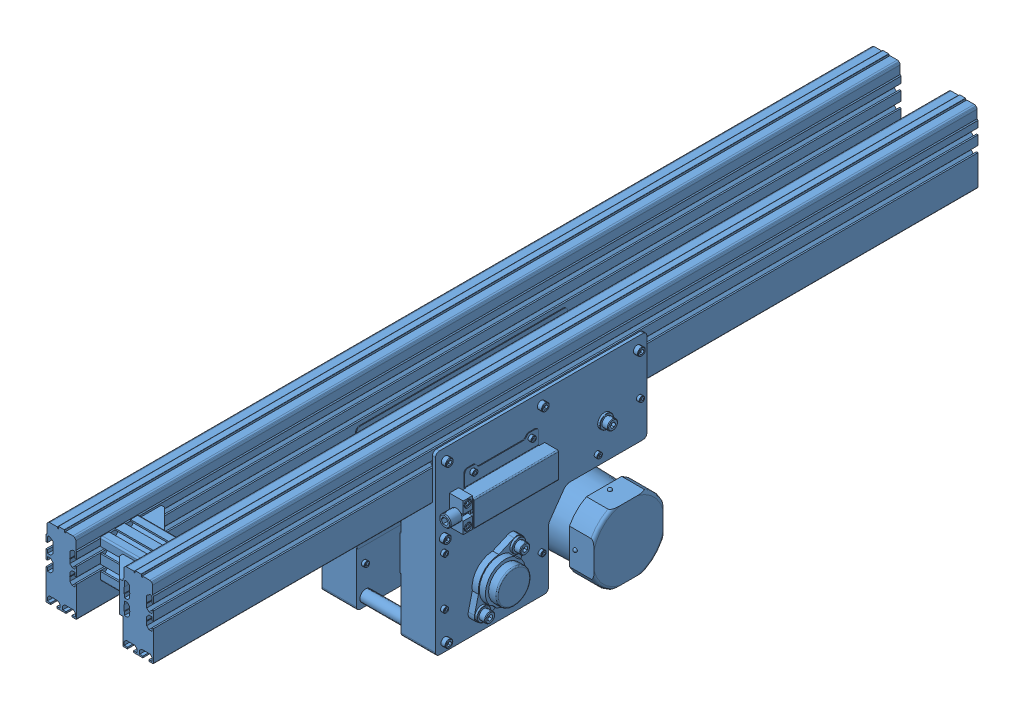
SolidWorks assembly _0818_SA91.SLDASM, configuration Default (file format 15000). Lengths in mm.
Overall size (241.72 280.99 1073).
8 component instances, 3 part files, 18 mates.
Components (placement in the parent):
- CV_CENTER_DRIVE-1: CV_CENTER_DRIVE.sldprt [Default] at (171 225 -885) x (0 0 1) z (-1 0 0) size (1073 270.99 241.72)
- Part2-1: Part2.SLDPRT [ﾃﾞﾌｫﾙﾄ] at (126 265.005 -140) x (0 0 -1) z (1 0 0) size (180 10 150)
- 0818_501_Palette-2: 0818_501_Palette.sldprt [Default] at (71 265.005 -395) x (0 0 -1) z (1 0 0) (suppressed, hidden)
- 0818_501_Palette-3: 0818_501_Palette.sldprt [Default] at (71 265.005 -625) x (0 0 -1) z (1 0 0) (suppressed, hidden)
- 0818_501_Palette-4: 0818_501_Palette.sldprt [Default] at (71 265.005 -855) x (0 0 -1) z (1 0 0) (suppressed, hidden)
- 0818_501_Palette-5: 0818_501_Palette.sldprt [Default] at (121 265.005 -985) x (0 0 -1) z (1 0 0) (suppressed, hidden)
- Part2-2: Part2.SLDPRT [ﾃﾞﾌｫﾙﾄ] at (126 265.005 -470) x (0 0 -1) z (1 0 0) size (180 10 150)
- Part2-3: Part2.SLDPRT [ﾃﾞﾌｫﾙﾄ] at (126 265.005 -800) x (0 0 -1) z (1 0 0) size (180 10 150)
Mates (geometry in assembly coordinates):
- Coincident1: coincident anti-aligned: plane of CV_CENTER_DRIVE-1 through (0 12.5 -624) normal (-1 0 0)
- Coincident2: coincident anti-aligned: plane of CV_CENTER_DRIVE-1 through (47 0 -633) normal (0 -1 0)
- Coincident3: coincident aligned: plane of CV_CENTER_DRIVE-1 through (71 225 0) normal (0 0 1)
- Coincident4: coincident anti-aligned: plane of CV_CENTER_DRIVE-1 through (67.3 265.005 -792.85) normal (0 1 0); plane of Part2-1 through (126 265.005 -140) normal (0 -1 0)
- Distance1: distance = 50 mm aligned: plane of Part2-1 through (51 265.005 -50) normal (0 0 1); plane of CV_CENTER_DRIVE-1 through (71 225 0) normal (0 0 1)
- Distance2: coincident aligned: plane of CV_CENTER_DRIVE-1 through (51 239.7 100.3195) normal (-1 0 0); plane of Part2-1 through (51 265.005 -230) normal (-1 0 0)
- Coincident7: coincident aligned: plane of Part2-1 through (126 275.005 -140) normal (0 1 0); plane of 0818_501_Palette-2 through (71 275.005 -395) normal (0 1 0)
- Coincident8: coincident aligned: plane of Part2-1 through (201 265.005 -50) normal (1 0 0); plane of 0818_501_Palette-2 through (171 275.005 -485) normal (1 0 0)
- Coincident9: distance = 50 mm anti-aligned: plane of Part2-1 through (201 265.005 -230) normal (0 0 -1); plane of 0818_501_Palette-2 through (171 275.005 -305) normal (0 0 1)
- Coincident10: distance = 50 mm anti-aligned: plane of 0818_501_Palette-2 through (171 275.005 -485) normal (0 0 -1); plane of 0818_501_Palette-3 through (171 275.005 -535) normal (0 0 1)
- Coincident11: coincident aligned: plane of 0818_501_Palette-2 through (71 275.005 -395) normal (0 1 0); plane of 0818_501_Palette-3 through (71 275.005 -625) normal (0 1 0)
- Coincident12: coincident aligned: plane of 0818_501_Palette-2 through (171 275.005 -485) normal (1 0 0); plane of 0818_501_Palette-3 through (171 275.005 -715) normal (1 0 0)
- Coincident13: coincident aligned: plane of 0818_501_Palette-3 through (71 275.005 -625) normal (0 1 0); plane of 0818_501_Palette-4 through (71 275.005 -855) normal (0 1 0)
- Coincident14: coincident aligned: plane of 0818_501_Palette-3 through (171 275.005 -715) normal (1 0 0); plane of 0818_501_Palette-4 through (171 275.005 -945) normal (1 0 0)
- Coincident15: distance = 50 mm anti-aligned: plane of 0818_501_Palette-3 through (171 275.005 -715) normal (0 0 -1); plane of 0818_501_Palette-4 through (171 275.005 -765) normal (0 0 1)
- Coincident16: coincident aligned: plane of 0818_501_Palette-4 through (71 275.005 -855) normal (0 1 0); plane of 0818_501_Palette-5 through (121 275.005 -935) normal (0 1 0)
- Coincident17: coincident anti-aligned: plane of 0818_501_Palette-4 through (171 275.005 -945) normal (0 0 -1); plane of 0818_501_Palette-5 through (221 275.005 -845) normal (0 0 1)
- Coincident18: coincident aligned: plane of 0818_501_Palette-4 through (171 275.005 -945) normal (1 0 0); plane of 0818_501_Palette-5 through (221 275.005 -1025) normal (1 0 0)
